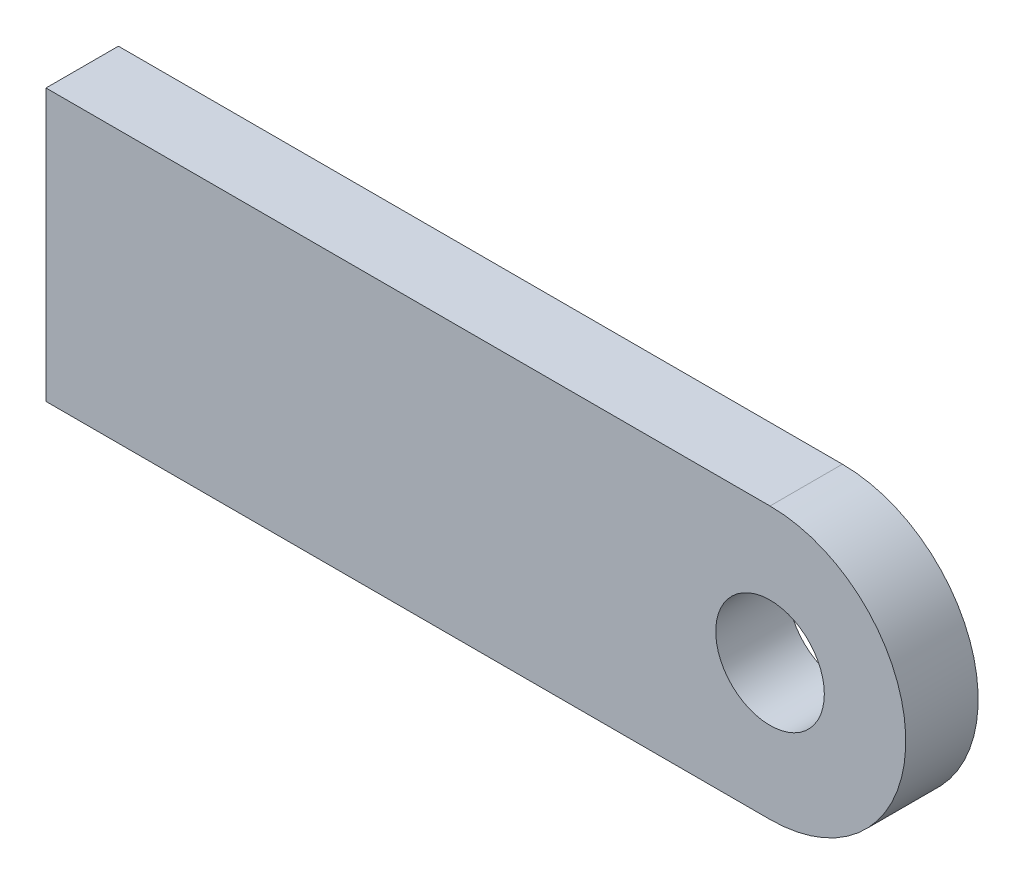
from build123d import *

# Parameters (mm, degrees)
SKETCH2_R           = 3.81
BOSS_EXTRUDE1_DEPTH = 2.54


with BuildPart() as part:
    # Sketch2 → Boss-Extrude1 (new, symmetric)
    with BuildSketch(Plane.XY):
        with BuildLine():
            ThreePointArc((50.8, 0), (60.325, -9.525), (50.8, -19.05))
            Line((50.8, -19.05), (0, -19.05))
            Line((0, -19.05), (0, 0))
            Line((0, 0), (50.8, 0))
        make_face()
        with Locations((50.8, -9.525)):
            Circle(SKETCH2_R, mode=Mode.SUBTRACT)
    extrude(amount=BOSS_EXTRUDE1_DEPTH, both=True)


solid = part.part
